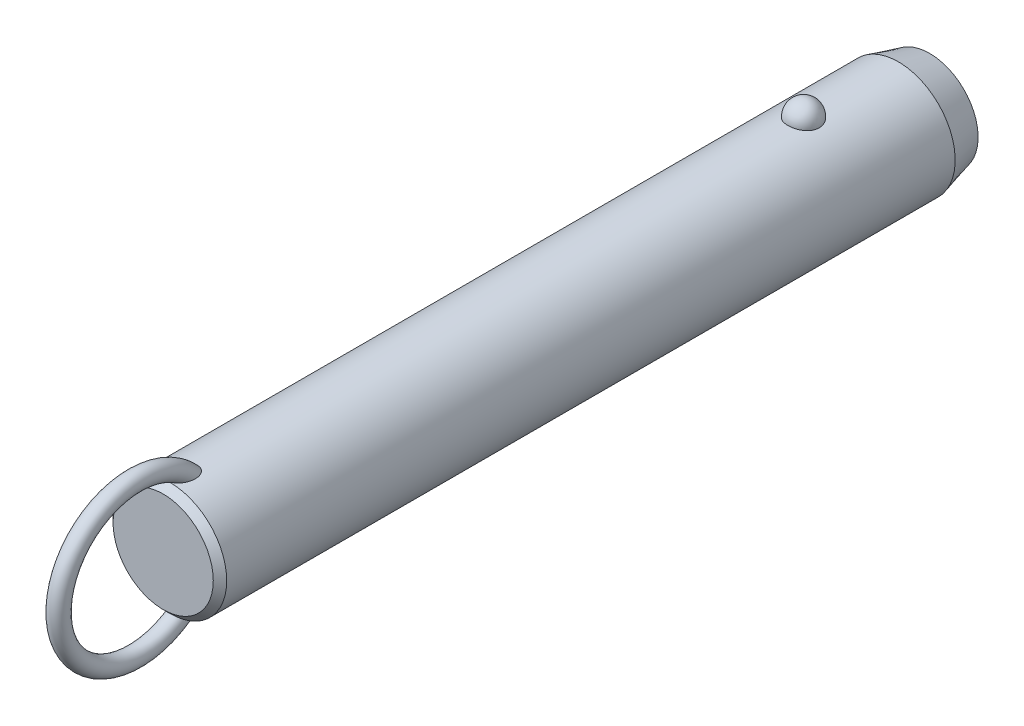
ISO-10303-21;
HEADER;
FILE_DESCRIPTION(('STEP AP214'),'2;1');
FILE_NAME('part.step','',(''),(''),'','','');
FILE_SCHEMA(('AUTOMOTIVE_DESIGN { 1 0 10303 214 1 1 1 1 }'));
ENDSEC;
DATA;
#1=APPLICATION_CONTEXT('core data for automotive mechanical design processes');
#2=APPLICATION_PROTOCOL_DEFINITION('international standard','automotive_design',2000,#1);
#3=PRODUCT_CONTEXT('',#1,'mechanical');
#4=PRODUCT('Part','Part','',(#3));
#5=PRODUCT_RELATED_PRODUCT_CATEGORY('part','',(#4));
#6=PRODUCT_DEFINITION_FORMATION('','',#4);
#7=PRODUCT_DEFINITION_CONTEXT('part definition',#1,'design');
#8=PRODUCT_DEFINITION('design','',#6,#7);
#9=PRODUCT_DEFINITION_SHAPE('','',#8);
#10=(LENGTH_UNIT() NAMED_UNIT(*) SI_UNIT(.MILLI.,.METRE.));
#11=(NAMED_UNIT(*) PLANE_ANGLE_UNIT() SI_UNIT($,.RADIAN.));
#12=(NAMED_UNIT(*) SI_UNIT($,.STERADIAN.) SOLID_ANGLE_UNIT());
#13=UNCERTAINTY_MEASURE_WITH_UNIT(LENGTH_MEASURE(1.E-05),#10,'distance_accuracy_value','');
#14=(GEOMETRIC_REPRESENTATION_CONTEXT(3) GLOBAL_UNCERTAINTY_ASSIGNED_CONTEXT((#13)) GLOBAL_UNIT_ASSIGNED_CONTEXT((#10,
#11,#12)) REPRESENTATION_CONTEXT('',''));
#15=CARTESIAN_POINT('',(0.,0.,0.));
#16=DIRECTION('',(0.,0.,1.));
#17=DIRECTION('',(1.,0.,0.));
#18=AXIS2_PLACEMENT_3D('',#15,#16,#17);
#19=CARTESIAN_POINT('',(0.,0.,127.));
#20=DIRECTION('',(0.,0.,-1.));
#21=DIRECTION('',(-1.,0.,0.));
#22=AXIS2_PLACEMENT_3D('',#19,#20,#21);
#23=CYLINDRICAL_SURFACE('',#22,12.7);
#24=CARTESIAN_POINT('',(3.46661256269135,12.2177165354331,-3.5));
#25=CARTESIAN_POINT('',(3.4666090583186,12.2177194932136,-3.30432790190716));
#26=CARTESIAN_POINT('',(3.45063567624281,12.2222841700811,-3.10861112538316));
#27=CARTESIAN_POINT('',(3.38712451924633,12.2400345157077,-2.72271899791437));
#28=CARTESIAN_POINT('',(3.33957415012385,12.2532236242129,-2.53254588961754));
#29=CARTESIAN_POINT('',(3.2141234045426,12.286724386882,-2.16324948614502));
#30=CARTESIAN_POINT('',(3.13623639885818,12.3070329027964,-1.98412136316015));
#31=CARTESIAN_POINT('',(2.95205930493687,12.3525018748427,-1.64180592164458));
#32=CARTESIAN_POINT('',(2.84577003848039,12.3776621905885,-1.47861814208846));
#33=CARTESIAN_POINT('',(2.60688050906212,12.4301712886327,-1.17190583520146));
#34=CARTESIAN_POINT('',(2.47415697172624,12.4575299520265,-1.02847897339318));
#35=CARTESIAN_POINT('',(2.18615174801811,12.5112810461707,-0.766177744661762));
#36=CARTESIAN_POINT('',(2.03087002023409,12.5376734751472,-0.64730342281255));
#37=CARTESIAN_POINT('',(1.70237334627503,12.5864761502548,-0.437732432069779));
#38=CARTESIAN_POINT('',(1.52920948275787,12.6088972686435,-0.346958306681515));
#39=CARTESIAN_POINT('',(1.16944170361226,12.6473352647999,-0.195750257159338));
#40=CARTESIAN_POINT('',(0.982839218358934,12.663352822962,-0.135313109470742));
#41=CARTESIAN_POINT('',(0.604961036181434,12.6869706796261,-0.0473241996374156));
#42=CARTESIAN_POINT('',(0.41382314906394,12.6947125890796,-0.0192185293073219));
#43=CARTESIAN_POINT('',(0.0293827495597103,12.7014203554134,0.0051725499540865));
#44=CARTESIAN_POINT('',(-0.163919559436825,12.7003870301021,0.00146092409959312));
#45=CARTESIAN_POINT('',(-0.544374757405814,12.689735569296,-0.0373939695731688));
#46=CARTESIAN_POINT('',(-0.731575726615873,12.6802364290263,-0.0721015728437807));
#47=CARTESIAN_POINT('',(-1.09733277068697,12.6538333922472,-0.171364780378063));
#48=CARTESIAN_POINT('',(-1.27588869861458,12.6369293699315,-0.235920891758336));
#49=CARTESIAN_POINT('',(-1.6204698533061,12.5973946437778,-0.393548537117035));
#50=CARTESIAN_POINT('',(-1.78641865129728,12.5747321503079,-0.486778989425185));
#51=CARTESIAN_POINT('',(-2.10030671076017,12.5261316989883,-0.699110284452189));
#52=CARTESIAN_POINT('',(-2.24824419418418,12.5001934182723,-0.818213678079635));
#53=CARTESIAN_POINT('',(-2.52491489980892,12.4472906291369,-1.08157124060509));
#54=CARTESIAN_POINT('',(-2.65324222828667,12.4203160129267,-1.22624992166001));
#55=CARTESIAN_POINT('',(-2.88410007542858,12.3687509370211,-1.53528325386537));
#56=CARTESIAN_POINT('',(-2.98662883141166,12.3441606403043,-1.69963924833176));
#57=CARTESIAN_POINT('',(-3.16432417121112,12.2998199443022,-2.04548497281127));
#58=CARTESIAN_POINT('',(-3.23917525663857,12.2801261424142,-2.22714424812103));
#59=CARTESIAN_POINT('',(-3.35800573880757,12.248167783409,-2.6009138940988));
#60=CARTESIAN_POINT('',(-3.4019860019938,12.2359030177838,-2.79302397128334));
#61=CARTESIAN_POINT('',(-3.45784812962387,12.2202347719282,-3.18140279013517));
#62=CARTESIAN_POINT('',(-3.46986123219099,12.2167950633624,-3.37765118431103));
#63=CARTESIAN_POINT('',(-3.46186273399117,12.2190638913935,-3.76943689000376));
#64=CARTESIAN_POINT('',(-3.44185196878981,12.2247721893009,-3.96497421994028));
#65=CARTESIAN_POINT('',(-3.37048652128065,12.2446381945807,-4.34881728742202));
#66=CARTESIAN_POINT('',(-3.31928253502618,12.2587552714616,-4.53715319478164));
#67=CARTESIAN_POINT('',(-3.18693461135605,12.2938237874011,-4.90231727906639));
#68=CARTESIAN_POINT('',(-3.1057895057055,12.3147754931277,-5.07914500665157));
#69=CARTESIAN_POINT('',(-2.91506431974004,12.3613125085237,-5.41732059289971));
#70=CARTESIAN_POINT('',(-2.80533587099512,12.3869217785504,-5.57858147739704));
#71=CARTESIAN_POINT('',(-2.560414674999,12.4398525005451,-5.88013283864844));
#72=CARTESIAN_POINT('',(-2.42522099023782,12.4671740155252,-6.02042254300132));
#73=CARTESIAN_POINT('',(-2.1323357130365,12.5205965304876,-6.27662798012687));
#74=CARTESIAN_POINT('',(-1.97456596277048,12.5466928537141,-6.3924554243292));
#75=CARTESIAN_POINT('',(-1.64115839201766,12.5946384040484,-6.59583547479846));
#76=CARTESIAN_POINT('',(-1.46552179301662,12.6164879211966,-6.68339001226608));
#77=CARTESIAN_POINT('',(-1.10356050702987,12.6532533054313,-6.82682153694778));
#78=CARTESIAN_POINT('',(-0.9173913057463,12.6682500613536,-6.8830698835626));
#79=CARTESIAN_POINT('',(-0.537836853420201,12.6900288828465,-6.96386887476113));
#80=CARTESIAN_POINT('',(-0.344452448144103,12.6968119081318,-6.9884232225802));
#81=CARTESIAN_POINT('',(0.0402577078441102,12.7013667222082,-7.00496469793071));
#82=CARTESIAN_POINT('',(0.231556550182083,12.6993008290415,-6.99753844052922));
#83=CARTESIAN_POINT('',(0.610105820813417,12.6867505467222,-6.9516636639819));
#84=CARTESIAN_POINT('',(0.797356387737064,12.6762664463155,-6.913216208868));
#85=CARTESIAN_POINT('',(1.16186657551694,12.6480587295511,-6.80658431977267));
#86=CARTESIAN_POINT('',(1.33915951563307,12.6303611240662,-6.73850666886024));
#87=CARTESIAN_POINT('',(1.67968518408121,12.5896027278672,-6.5745087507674));
#88=CARTESIAN_POINT('',(1.84291705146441,12.5665416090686,-6.47858678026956));
#89=CARTESIAN_POINT('',(2.15340192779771,12.5171072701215,-6.25982455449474));
#90=CARTESIAN_POINT('',(2.30037831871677,12.4906895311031,-6.13660186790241));
#91=CARTESIAN_POINT('',(2.5717412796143,12.4376567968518,-5.86739587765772));
#92=CARTESIAN_POINT('',(2.69612388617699,12.4110417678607,-5.72140858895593));
#93=CARTESIAN_POINT('',(2.92107785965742,12.360051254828,-5.40794137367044));
#94=CARTESIAN_POINT('',(3.02121329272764,12.3357209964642,-5.24014110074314));
#95=CARTESIAN_POINT('',(3.19236291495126,12.2925446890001,-4.88969865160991));
#96=CARTESIAN_POINT('',(3.26338839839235,12.2736965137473,-4.70706226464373));
#97=CARTESIAN_POINT('',(3.36788038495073,12.245404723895,-4.35469510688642));
#98=CARTESIAN_POINT('',(3.40484026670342,12.2351018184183,-4.18605935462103));
#99=CARTESIAN_POINT('',(3.45420764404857,12.2212564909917,-3.84496058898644));
#100=CARTESIAN_POINT('',(3.46661565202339,12.2177139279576,-3.67249765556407));
#101=CARTESIAN_POINT('',(3.46661256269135,12.2177165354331,-3.5));
#102=B_SPLINE_CURVE_WITH_KNOTS('',3,(#24,#25,#26,#27,#28,#29,#30,#31,#32,#33,#34,#35,#36,#37,
#38,#39,#40,#41,#42,#43,#44,#45,#46,#47,#48,#49,#50,#51,#52,#53,#54,#55,#56,#57,#58,#59,#60,#61,
#62,#63,#64,#65,#66,#67,#68,#69,#70,#71,#72,#73,#74,#75,#76,#77,#78,#79,#80,#81,#82,#83,#84,#85,
#86,#87,#88,#89,#90,#91,#92,#93,#94,#95,#96,#97,#98,#99,#100,#101),.UNSPECIFIED.,.T.,.F.,(4,2,2,
2,2,2,2,2,2,2,2,2,2,2,2,2,2,2,2,2,2,2,2,2,2,2,2,2,2,2,2,2,2,2,2,2,2,2,4),(0.,0.586396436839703,
1.17302689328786,1.7593990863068,2.34575431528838,2.93491084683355,3.52406845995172,
4.11158733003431,4.69904375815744,5.2762784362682,5.85345931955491,6.42265312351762,
6.99185659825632,7.56427334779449,8.136746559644,8.71981013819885,9.3029135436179,
9.89247258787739,10.4820150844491,11.0691335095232,11.6562366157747,12.2405256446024,
12.8248374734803,13.412244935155,13.9996740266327,14.5891883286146,15.1786623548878,
15.7609861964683,16.3432419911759,16.9148635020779,17.4864654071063,18.0560241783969,
18.6256177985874,19.2037609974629,19.7820055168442,20.3699810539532,20.957728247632,
21.4746855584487,21.9916320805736),.UNSPECIFIED.);
#103=CARTESIAN_POINT('',(3.46661256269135,12.2177165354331,-3.5));
#104=VERTEX_POINT('',#103);
#105=EDGE_CURVE('E41',#104,#104,#102,.T.);
#106=ORIENTED_EDGE('',*,*,#105,.T.);
#107=EDGE_LOOP('',(#106));
#108=FACE_BOUND('',#107,.T.);
#109=CARTESIAN_POINT('',(0.,0.,138.2));
#110=DIRECTION('',(0.,0.,1.));
#111=DIRECTION('',(1.,0.,0.));
#112=AXIS2_PLACEMENT_3D('',#109,#110,#111);
#113=CIRCLE('',#112,12.7);
#114=CARTESIAN_POINT('',(12.7,0.,138.2));
#115=VERTEX_POINT('',#114);
#116=EDGE_CURVE('E10',#115,#115,#113,.F.);
#117=ORIENTED_EDGE('',*,*,#116,.T.);
#118=EDGE_LOOP('',(#117));
#119=FACE_BOUND('',#118,.T.);
#120=CARTESIAN_POINT('',(-0.548122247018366,-12.6881662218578,131.943218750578));
#121=CARTESIAN_POINT('',(-0.648865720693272,-12.6838128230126,131.977926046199));
#122=CARTESIAN_POINT('',(-0.746398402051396,-12.6783867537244,132.022042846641));
#123=CARTESIAN_POINT('',(-0.932125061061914,-12.666091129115,132.126764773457));
#124=CARTESIAN_POINT('',(-1.02030388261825,-12.6592192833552,132.187396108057));
#125=CARTESIAN_POINT('',(-1.18487740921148,-12.6448747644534,132.321847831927));
#126=CARTESIAN_POINT('',(-1.26134296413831,-12.637406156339,132.395582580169));
#127=CARTESIAN_POINT('',(-1.4023120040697,-12.6225412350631,132.553604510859));
#128=CARTESIAN_POINT('',(-1.466814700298,-12.6151449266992,132.63789238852));
#129=CARTESIAN_POINT('',(-1.60714786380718,-12.5981718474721,132.849657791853));
#130=CARTESIAN_POINT('',(-1.67725126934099,-12.588900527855,132.980962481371));
#131=CARTESIAN_POINT('',(-1.79536591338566,-12.5725964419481,133.253247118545));
#132=CARTESIAN_POINT('',(-1.84333535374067,-12.5655679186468,133.394244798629));
#133=CARTESIAN_POINT('',(-1.93422576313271,-12.5519624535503,133.737645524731));
#134=CARTESIAN_POINT('',(-1.96788773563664,-12.5466298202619,133.942557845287));
#135=CARTESIAN_POINT('',(-1.9941399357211,-12.542463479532,134.251760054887));
#136=CARTESIAN_POINT('',(-1.99883864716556,-12.5417153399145,134.355298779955));
#137=CARTESIAN_POINT('',(-2.00078003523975,-12.5414074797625,134.56245124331));
#138=CARTESIAN_POINT('',(-1.99802449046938,-12.5418474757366,134.666064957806));
#139=CARTESIAN_POINT('',(-1.98336733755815,-12.5441750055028,134.91032076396));
#140=CARTESIAN_POINT('',(-1.96851430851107,-12.5465291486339,135.050780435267));
#141=CARTESIAN_POINT('',(-1.92707089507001,-12.5529612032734,135.329960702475));
#142=CARTESIAN_POINT('',(-1.90047458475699,-12.5570399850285,135.468680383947));
#143=CARTESIAN_POINT('',(-1.8361912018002,-12.5666008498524,135.74341135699));
#144=CARTESIAN_POINT('',(-1.79850828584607,-12.57208240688,135.879423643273));
#145=CARTESIAN_POINT('',(-1.71223796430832,-12.5841228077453,136.147842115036));
#146=CARTESIAN_POINT('',(-1.66365679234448,-12.5906810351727,136.280250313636));
#147=CARTESIAN_POINT('',(-1.5780450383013,-12.6016176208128,136.48548877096));
#148=CARTESIAN_POINT('',(-1.54477252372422,-12.6057501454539,136.559914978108));
#149=CARTESIAN_POINT('',(-1.47424480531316,-12.6141930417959,136.706839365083));
#150=CARTESIAN_POINT('',(-1.436990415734,-12.6185033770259,136.779337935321));
#151=CARTESIAN_POINT('',(-1.35825795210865,-12.6272207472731,136.921892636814));
#152=CARTESIAN_POINT('',(-1.31678520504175,-12.6316276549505,136.991951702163));
#153=CARTESIAN_POINT('',(-1.22917793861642,-12.6404532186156,137.129070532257));
#154=CARTESIAN_POINT('',(-1.18304514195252,-12.6448718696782,137.196131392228));
#155=CARTESIAN_POINT('',(-1.07246411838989,-12.6547893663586,137.343874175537));
#156=CARTESIAN_POINT('',(-1.00642239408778,-12.6602600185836,137.423384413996));
#157=CARTESIAN_POINT('',(-0.86444142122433,-12.6707460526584,137.573169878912));
#158=CARTESIAN_POINT('',(-0.788516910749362,-12.6757620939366,137.643458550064));
#159=CARTESIAN_POINT('',(-0.652215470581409,-12.6833591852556,137.748680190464));
#160=CARTESIAN_POINT('',(-0.59498203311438,-12.6861973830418,137.787624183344));
#161=CARTESIAN_POINT('',(-0.475269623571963,-12.6912445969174,137.856489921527));
#162=CARTESIAN_POINT('',(-0.412800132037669,-12.6934547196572,137.886427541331));
#163=CARTESIAN_POINT('',(-0.295749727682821,-12.6966636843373,137.92975652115));
#164=CARTESIAN_POINT('',(-0.241949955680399,-12.6978134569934,137.945218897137));
#165=CARTESIAN_POINT('',(-0.132508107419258,-12.6994261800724,137.966884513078));
#166=CARTESIAN_POINT('',(-0.0768679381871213,-12.6998898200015,137.973097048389));
#167=CARTESIAN_POINT('',(0.0347696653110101,-12.7000752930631,137.975583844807));
#168=CARTESIAN_POINT('',(0.0907676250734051,-12.6997954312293,137.971835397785));
#169=CARTESIAN_POINT('',(0.201283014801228,-12.6985255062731,137.954788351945));
#170=CARTESIAN_POINT('',(0.255799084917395,-12.6975348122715,137.941481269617));
#171=CARTESIAN_POINT('',(0.376042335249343,-12.6946091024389,137.90203792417));
#172=CARTESIAN_POINT('',(0.440950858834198,-12.6924943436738,137.873449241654));
#173=CARTESIAN_POINT('',(0.565350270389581,-12.6875639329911,137.806323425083));
#174=CARTESIAN_POINT('',(0.624828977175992,-12.6847467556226,137.767764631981));
#175=CARTESIAN_POINT('',(0.774116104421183,-12.6767252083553,137.656949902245));
#176=CARTESIAN_POINT('',(0.859449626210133,-12.6711344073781,137.578760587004));
#177=CARTESIAN_POINT('',(1.01789440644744,-12.6593922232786,137.410943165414));
#178=CARTESIAN_POINT('',(1.09096902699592,-12.653239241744,137.321282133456));
#179=CARTESIAN_POINT('',(1.22268793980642,-12.6411674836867,137.140265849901));
#180=CARTESIAN_POINT('',(1.28193986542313,-12.6352572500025,137.049345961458));
#181=CARTESIAN_POINT('',(1.39259777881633,-12.6235401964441,136.862792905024));
#182=CARTESIAN_POINT('',(1.44399707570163,-12.6177334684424,136.767155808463));
#183=CARTESIAN_POINT('',(1.53972870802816,-12.6064093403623,136.572273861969));
#184=CARTESIAN_POINT('',(1.58405262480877,-12.6008922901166,136.473024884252));
#185=CARTESIAN_POINT('',(1.66600705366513,-12.5903187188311,136.271772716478));
#186=CARTESIAN_POINT('',(1.70363651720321,-12.5852622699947,136.169769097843));
#187=CARTESIAN_POINT('',(1.77545379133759,-12.5753406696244,135.954358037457));
#188=CARTESIAN_POINT('',(1.80903453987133,-12.5705328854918,135.840745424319));
#189=CARTESIAN_POINT('',(1.86844163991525,-12.5618400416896,135.611457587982));
#190=CARTESIAN_POINT('',(1.89426665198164,-12.5579551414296,135.495782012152));
#191=CARTESIAN_POINT('',(1.93785464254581,-12.5513030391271,135.263007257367));
#192=CARTESIAN_POINT('',(1.95562640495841,-12.5485346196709,135.145909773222));
#193=CARTESIAN_POINT('',(1.98264463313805,-12.5442934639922,134.910747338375));
#194=CARTESIAN_POINT('',(1.99189298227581,-12.5428204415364,134.79268260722));
#195=CARTESIAN_POINT('',(2.00416068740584,-12.540871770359,134.480622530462));
#196=CARTESIAN_POINT('',(1.99944433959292,-12.541631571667,134.286229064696));
#197=CARTESIAN_POINT('',(1.96113755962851,-12.5476846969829,133.900309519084));
#198=CARTESIAN_POINT('',(1.92758341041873,-12.5529723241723,133.708780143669));
#199=CARTESIAN_POINT('',(1.83934342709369,-12.5661532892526,133.382272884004));
#200=CARTESIAN_POINT('',(1.79215440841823,-12.5730485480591,133.24524997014));
#201=CARTESIAN_POINT('',(1.67676242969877,-12.588958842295,132.980445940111));
#202=CARTESIAN_POINT('',(1.60859050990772,-12.597970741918,132.852651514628));
#203=CARTESIAN_POINT('',(1.46583832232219,-12.6152829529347,132.635800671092));
#204=CARTESIAN_POINT('',(1.39525727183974,-12.6233659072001,132.54410500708));
#205=CARTESIAN_POINT('',(1.23992594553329,-12.6395676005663,132.373485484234));
#206=CARTESIAN_POINT('',(1.15517932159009,-12.6476863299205,132.294558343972));
#207=CARTESIAN_POINT('',(0.971995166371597,-12.6630846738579,132.152643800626));
#208=CARTESIAN_POINT('',(0.873456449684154,-12.6703572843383,132.089784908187));
#209=CARTESIAN_POINT('',(0.665847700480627,-12.6829569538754,131.984487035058));
#210=CARTESIAN_POINT('',(0.556784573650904,-12.688285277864,131.942034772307));
#211=CARTESIAN_POINT('',(0.347338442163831,-12.6956226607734,131.884443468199));
#212=CARTESIAN_POINT('',(0.247759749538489,-12.6979816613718,131.866399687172));
#213=CARTESIAN_POINT('',(0.0470218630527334,-12.7003077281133,131.848600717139));
#214=CARTESIAN_POINT('',(-0.0541350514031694,-12.7002779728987,131.848821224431));
#215=CARTESIAN_POINT('',(-0.221414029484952,-12.6982482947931,131.864363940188));
#216=CARTESIAN_POINT('',(-0.288055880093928,-12.6969033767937,131.874666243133));
#217=CARTESIAN_POINT('',(-0.419599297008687,-12.6932369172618,131.90313489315));
#218=CARTESIAN_POINT('',(-0.484501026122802,-12.6909154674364,131.921300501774));
#219=CARTESIAN_POINT('',(-0.548122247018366,-12.6881662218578,131.943218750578));
#220=B_SPLINE_CURVE_WITH_KNOTS('',3,(#120,#121,#122,#123,#124,#125,#126,#127,#128,#129,#130,
#131,#132,#133,#134,#135,#136,#137,#138,#139,#140,#141,#142,#143,#144,#145,#146,#147,#148,#149,
#150,#151,#152,#153,#154,#155,#156,#157,#158,#159,#160,#161,#162,#163,#164,#165,#166,#167,#168,
#169,#170,#171,#172,#173,#174,#175,#176,#177,#178,#179,#180,#181,#182,#183,#184,#185,#186,#187,
#188,#189,#190,#191,#192,#193,#194,#195,#196,#197,#198,#199,#200,#201,#202,#203,#204,#205,#206,
#207,#208,#209,#210,#211,#212,#213,#214,#215,#216,#217,#218,#219),.UNSPECIFIED.,.T.,.F.,(4,2,2,
2,2,2,2,2,2,2,2,2,2,2,2,2,2,2,2,2,2,2,2,2,2,2,2,2,2,2,2,2,2,2,2,2,2,2,2,2,2,2,2,2,2,2,2,2,2,4),
(0.,0.31964225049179,0.639794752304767,0.957927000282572,1.27608021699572,1.72100165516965,
2.16675988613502,2.78630021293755,3.09705782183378,3.40774128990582,3.83096358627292,
4.25439969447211,4.67767724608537,5.10071330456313,5.34550297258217,5.59024267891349,
5.83467707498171,6.07902143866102,6.38891080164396,6.69834321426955,6.9056091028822,
7.11250749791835,7.27977315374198,7.44687060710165,7.61434932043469,7.78197685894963,
7.99365544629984,8.20579780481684,8.55147335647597,8.89816429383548,9.22375138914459,
9.54961437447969,9.8758622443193,10.202161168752,10.557587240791,10.9130746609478,
11.2681734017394,11.6231936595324,12.2046601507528,12.7853961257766,13.219164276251,
13.6522938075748,13.9989174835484,14.3454519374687,14.6946768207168,15.0436740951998,
15.3457513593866,15.6474266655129,15.8493051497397,16.0511646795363),.UNSPECIFIED.);
#221=CARTESIAN_POINT('',(-0.548122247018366,-12.6881662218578,131.943218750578));
#222=VERTEX_POINT('',#221);
#223=EDGE_CURVE('E59',#222,#222,#220,.T.);
#224=ORIENTED_EDGE('',*,*,#223,.T.);
#225=EDGE_LOOP('',(#224));
#226=FACE_BOUND('',#225,.T.);
#227=CARTESIAN_POINT('',(-0.548122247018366,12.6881662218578,131.943218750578));
#228=CARTESIAN_POINT('',(-0.459436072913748,12.6919968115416,131.912673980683));
#229=CARTESIAN_POINT('',(-0.368189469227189,12.6949996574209,131.889391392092));
#230=CARTESIAN_POINT('',(-0.183024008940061,12.6990186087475,131.858406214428));
#231=CARTESIAN_POINT('',(-0.0891049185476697,12.7000345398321,131.850704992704));
#232=CARTESIAN_POINT('',(0.0987147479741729,12.6999636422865,131.851245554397));
#233=CARTESIAN_POINT('',(0.192615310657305,12.6988761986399,131.859492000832));
#234=CARTESIAN_POINT('',(0.377658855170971,12.6947211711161,131.891551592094));
#235=CARTESIAN_POINT('',(0.468801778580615,12.6916535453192,131.915365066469));
#236=CARTESIAN_POINT('',(0.645809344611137,12.6838788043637,131.97745651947));
#237=CARTESIAN_POINT('',(0.731679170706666,12.6791733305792,132.015720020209));
#238=CARTESIAN_POINT('',(0.896315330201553,12.6686004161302,132.105120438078));
#239=CARTESIAN_POINT('',(0.97508059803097,12.6627328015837,132.156259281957));
#240=CARTESIAN_POINT('',(1.12963655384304,12.6499161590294,132.27367820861));
#241=CARTESIAN_POINT('',(1.20478673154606,12.6429194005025,132.340792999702));
#242=CARTESIAN_POINT('',(1.34448241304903,12.6288282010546,132.48522507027));
#243=CARTESIAN_POINT('',(1.40902173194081,12.621733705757,132.562548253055));
#244=CARTESIAN_POINT('',(1.55208211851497,12.6050877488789,132.759247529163));
#245=CARTESIAN_POINT('',(1.62510490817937,12.5957546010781,132.882654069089));
#246=CARTESIAN_POINT('',(1.7501904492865,12.5789823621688,133.139769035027));
#247=CARTESIAN_POINT('',(1.8022137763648,12.5715468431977,133.273496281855));
#248=CARTESIAN_POINT('',(1.90309965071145,12.5567434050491,133.598351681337));
#249=CARTESIAN_POINT('',(1.94342317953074,12.5504515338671,133.792161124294));
#250=CARTESIAN_POINT('',(1.99332997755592,12.5426147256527,134.18378810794));
#251=CARTESIAN_POINT('',(2.00285305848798,12.5410790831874,134.381612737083));
#252=CARTESIAN_POINT('',(1.99678999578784,12.5420407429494,134.716642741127));
#253=CARTESIAN_POINT('',(1.98794117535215,12.5434564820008,134.854042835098));
#254=CARTESIAN_POINT('',(1.95865119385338,12.5480641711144,135.127639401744));
#255=CARTESIAN_POINT('',(1.93820436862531,12.5512569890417,135.263835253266));
#256=CARTESIAN_POINT('',(1.88647896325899,12.5591352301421,135.534249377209));
#257=CARTESIAN_POINT('',(1.85518800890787,12.5638223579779,135.668465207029));
#258=CARTESIAN_POINT('',(1.78217886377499,12.5743868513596,135.933936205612));
#259=CARTESIAN_POINT('',(1.74046509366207,12.5802637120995,136.065192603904));
#260=CARTESIAN_POINT('',(1.66024095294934,12.5910571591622,136.286085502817));
#261=CARTESIAN_POINT('',(1.62434772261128,12.5957535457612,136.376690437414));
#262=CARTESIAN_POINT('',(1.54709009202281,12.6054762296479,136.555512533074));
#263=CARTESIAN_POINT('',(1.50572681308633,12.6105024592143,136.643730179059));
#264=CARTESIAN_POINT('',(1.41728020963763,12.620748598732,136.816932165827));
#265=CARTESIAN_POINT('',(1.37021377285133,12.625967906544,136.901925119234));
#266=CARTESIAN_POINT('',(1.26969620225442,12.6364721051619,137.068007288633));
#267=CARTESIAN_POINT('',(1.21624929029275,12.6417569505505,137.149099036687));
#268=CARTESIAN_POINT('',(1.10304413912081,12.6521331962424,137.304702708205));
#269=CARTESIAN_POINT('',(1.04340936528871,12.657226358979,137.379303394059));
#270=CARTESIAN_POINT('',(0.915919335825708,12.667090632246,137.521324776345));
#271=CARTESIAN_POINT('',(0.84806456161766,12.6718617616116,137.58874589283));
#272=CARTESIAN_POINT('',(0.717035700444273,12.67987711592,137.700624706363));
#273=CARTESIAN_POINT('',(0.655526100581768,12.6832377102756,137.746997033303));
#274=CARTESIAN_POINT('',(0.525985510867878,12.6892676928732,137.829619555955));
#275=CARTESIAN_POINT('',(0.457969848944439,12.6919386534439,137.865892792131));
#276=CARTESIAN_POINT('',(0.334859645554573,12.695691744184,137.916657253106));
#277=CARTESIAN_POINT('',(0.281116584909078,12.6970073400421,137.934373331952));
#278=CARTESIAN_POINT('',(0.171425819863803,12.6989609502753,137.960642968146));
#279=CARTESIAN_POINT('',(0.115480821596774,12.699599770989,137.969207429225));
#280=CARTESIAN_POINT('',(0.00272618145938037,12.7001251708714,137.976253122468));
#281=CARTESIAN_POINT('',(-0.0540859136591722,12.7000089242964,137.974696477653));
#282=CARTESIAN_POINT('',(-0.16654462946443,12.6990328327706,137.961600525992));
#283=CARTESIAN_POINT('',(-0.222190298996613,12.6981724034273,137.950053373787));
#284=CARTESIAN_POINT('',(-0.342018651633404,12.695562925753,137.914912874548));
#285=CARTESIAN_POINT('',(-0.405606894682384,12.6936676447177,137.88933225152));
#286=CARTESIAN_POINT('',(-0.527815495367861,12.6891754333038,137.828311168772));
#287=CARTESIAN_POINT('',(-0.586425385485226,12.6865770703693,137.792850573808));
#288=CARTESIAN_POINT('',(-0.731842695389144,12.6792129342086,137.691496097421));
#289=CARTESIAN_POINT('',(-0.81470941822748,12.6740767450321,137.6200395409));
#290=CARTESIAN_POINT('',(-0.969101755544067,12.6632083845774,137.46589007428));
#291=CARTESIAN_POINT('',(-1.04059564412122,12.6574746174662,137.383166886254));
#292=CARTESIAN_POINT('',(-1.16981116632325,12.6461638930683,137.215809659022));
#293=CARTESIAN_POINT('',(-1.22811369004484,12.6405994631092,137.131616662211));
#294=CARTESIAN_POINT('',(-1.33743405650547,12.6295007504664,136.958579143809));
#295=CARTESIAN_POINT('',(-1.38844577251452,12.6239664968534,136.869730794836));
#296=CARTESIAN_POINT('',(-1.48400702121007,12.6130898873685,136.688389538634));
#297=CARTESIAN_POINT('',(-1.52854232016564,12.6077479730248,136.595889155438));
#298=CARTESIAN_POINT('',(-1.61150113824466,12.5974127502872,136.408160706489));
#299=CARTESIAN_POINT('',(-1.64992317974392,12.5924195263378,136.312931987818));
#300=CARTESIAN_POINT('',(-1.73468589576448,12.581070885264,136.08289362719));
#301=CARTESIAN_POINT('',(-1.77831261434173,12.5749388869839,135.947066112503));
#302=CARTESIAN_POINT('',(-1.85439734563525,12.5639437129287,135.672212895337));
#303=CARTESIAN_POINT('',(-1.88684994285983,12.5590811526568,135.533185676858));
#304=CARTESIAN_POINT('',(-1.94008483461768,12.550968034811,135.25309235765));
#305=CARTESIAN_POINT('',(-1.96088706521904,12.5477147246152,135.112030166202));
#306=CARTESIAN_POINT('',(-1.99000539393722,12.5431291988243,134.828668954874));
#307=CARTESIAN_POINT('',(-1.99832911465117,12.5417958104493,134.686370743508));
#308=CARTESIAN_POINT('',(-2.00166624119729,12.5412674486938,134.357627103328));
#309=CARTESIAN_POINT('',(-1.99178843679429,12.5428579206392,134.171088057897));
#310=CARTESIAN_POINT('',(-1.94455183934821,12.5502731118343,133.80162404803));
#311=CARTESIAN_POINT('',(-1.90724032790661,12.5560905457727,133.618693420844));
#312=CARTESIAN_POINT('',(-1.81330718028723,12.5699462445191,133.304848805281));
#313=CARTESIAN_POINT('',(-1.76338820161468,12.5771273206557,133.171910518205));
#314=CARTESIAN_POINT('',(-1.64305018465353,12.593414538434,132.915681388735));
#315=CARTESIAN_POINT('',(-1.57265346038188,12.6025185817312,132.792380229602));
#316=CARTESIAN_POINT('',(-1.42634956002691,12.6198178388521,132.583564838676));
#317=CARTESIAN_POINT('',(-1.35423772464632,12.6278405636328,132.495384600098));
#318=CARTESIAN_POINT('',(-1.19645664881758,12.6437632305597,132.332107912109));
#319=CARTESIAN_POINT('',(-1.1108053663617,12.6516633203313,132.256994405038));
#320=CARTESIAN_POINT('',(-0.947219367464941,12.6648319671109,132.137811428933));
#321=CARTESIAN_POINT('',(-0.871624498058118,12.670300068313,132.090541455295));
#322=CARTESIAN_POINT('',(-0.714161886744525,12.6801492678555,132.0077413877));
#323=CARTESIAN_POINT('',(-0.632295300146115,12.684530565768,131.97220913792));
#324=CARTESIAN_POINT('',(-0.548122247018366,12.6881662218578,131.943218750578));
#325=B_SPLINE_CURVE_WITH_KNOTS('',3,(#227,#228,#229,#230,#231,#232,#233,#234,#235,#236,#237,
#238,#239,#240,#241,#242,#243,#244,#245,#246,#247,#248,#249,#250,#251,#252,#253,#254,#255,#256,
#257,#258,#259,#260,#261,#262,#263,#264,#265,#266,#267,#268,#269,#270,#271,#272,#273,#274,#275,
#276,#277,#278,#279,#280,#281,#282,#283,#284,#285,#286,#287,#288,#289,#290,#291,#292,#293,#294,
#295,#296,#297,#298,#299,#300,#301,#302,#303,#304,#305,#306,#307,#308,#309,#310,#311,#312,#313,
#314,#315,#316,#317,#318,#319,#320,#321,#322,#323,#324),.UNSPECIFIED.,.T.,.F.,(4,2,2,2,2,2,2,2,
2,2,2,2,2,2,2,2,2,2,2,2,2,2,2,2,2,2,2,2,2,2,2,2,2,2,2,2,2,2,2,2,2,2,2,2,2,2,2,2,4),(0.,
0.281328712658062,0.562682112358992,0.844117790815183,1.12555942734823,1.40671982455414,
1.68792232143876,1.98972294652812,2.29169886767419,2.72039860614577,3.14989948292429,
3.74084916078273,4.33295293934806,4.74554109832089,5.15833092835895,5.57159335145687,
5.98468079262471,6.27722775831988,6.56971484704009,6.86135609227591,7.15280542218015,
7.43927407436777,7.72572595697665,7.95635862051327,8.18646071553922,8.35559393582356,
8.52452541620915,8.69408946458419,8.86378678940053,9.06834348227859,9.27332014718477,
9.60010414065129,9.92778432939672,10.2350252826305,10.5425229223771,10.8506864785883,
11.15892440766,11.5867893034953,12.0148612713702,12.4421984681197,12.8692745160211,
13.4279365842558,13.9856380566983,14.4107062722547,14.835313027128,15.1765567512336,
15.517351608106,15.7844129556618,16.051425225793),.UNSPECIFIED.);
#326=CARTESIAN_POINT('',(-0.548122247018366,12.6881662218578,131.943218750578));
#327=VERTEX_POINT('',#326);
#328=EDGE_CURVE('E67',#327,#327,#325,.T.);
#329=ORIENTED_EDGE('',*,*,#328,.T.);
#330=EDGE_LOOP('',(#329));
#331=FACE_BOUND('',#330,.T.);
#332=CARTESIAN_POINT('',(0.,0.,-24.6999999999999));
#333=DIRECTION('',(0.,0.,-1.));
#334=DIRECTION('',(-1.,0.,0.));
#335=AXIS2_PLACEMENT_3D('',#332,#333,#334);
#336=CIRCLE('',#335,12.7);
#337=CARTESIAN_POINT('',(-12.7,0.,-24.6999999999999));
#338=VERTEX_POINT('',#337);
#339=EDGE_CURVE('E56',#338,#338,#336,.F.);
#340=ORIENTED_EDGE('',*,*,#339,.T.);
#341=EDGE_LOOP('',(#340));
#342=FACE_BOUND('',#341,.T.);
#343=ADVANCED_FACE('F37',(#108,#119,#226,#331,#342),#23,.T.);
#344=CARTESIAN_POINT('',(0.,0.,-31.7));
#345=DIRECTION('',(0.,0.,-1.));
#346=DIRECTION('',(-1.,0.,0.));
#347=AXIS2_PLACEMENT_3D('',#344,#345,#346);
#348=PLANE('',#347);
#349=CARTESIAN_POINT('',(0.,0.,-31.7));
#350=DIRECTION('',(0.,0.,-1.));
#351=DIRECTION('',(-1.,0.,0.));
#352=AXIS2_PLACEMENT_3D('',#349,#350,#351);
#353=CIRCLE('',#352,10.8243556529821);
#354=CARTESIAN_POINT('',(-10.8243556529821,0.,-31.7));
#355=VERTEX_POINT('',#354);
#356=EDGE_CURVE('E66',#355,#355,#353,.T.);
#357=ORIENTED_EDGE('',*,*,#356,.T.);
#358=EDGE_LOOP('',(#357));
#359=FACE_BOUND('',#358,.T.);
#360=ADVANCED_FACE('F85',(#359),#348,.T.);
#361=CARTESIAN_POINT('',(0.,0.,-31.7));
#362=DIRECTION('',(0.,0.,1.));
#363=DIRECTION('',(1.,0.,0.));
#364=AXIS2_PLACEMENT_3D('',#361,#362,#363);
#365=CONICAL_SURFACE('',#364,10.8243556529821,0.261799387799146);
#366=ORIENTED_EDGE('',*,*,#339,.F.);
#367=EDGE_LOOP('',(#366));
#368=FACE_BOUND('',#367,.T.);
#369=ORIENTED_EDGE('',*,*,#356,.F.);
#370=EDGE_LOOP('',(#369));
#371=FACE_BOUND('',#370,.T.);
#372=ADVANCED_FACE('F83',(#368,#371),#365,.T.);
#373=CARTESIAN_POINT('',(0.,0.,139.7));
#374=DIRECTION('',(0.,0.,1.));
#375=DIRECTION('',(1.,0.,0.));
#376=AXIS2_PLACEMENT_3D('',#373,#374,#375);
#377=PLANE('',#376);
#378=CARTESIAN_POINT('',(0.,0.,139.7));
#379=DIRECTION('',(0.,0.,1.));
#380=DIRECTION('',(1.,0.,0.));
#381=AXIS2_PLACEMENT_3D('',#378,#379,#380);
#382=CIRCLE('',#381,11.2);
#383=CARTESIAN_POINT('',(11.2,0.,139.7));
#384=VERTEX_POINT('',#383);
#385=EDGE_CURVE('E50',#384,#384,#382,.T.);
#386=ORIENTED_EDGE('',*,*,#385,.T.);
#387=EDGE_LOOP('',(#386));
#388=FACE_BOUND('',#387,.T.);
#389=ADVANCED_FACE('F77',(#388),#377,.T.);
#390=CARTESIAN_POINT('',(0.,0.,146.05));
#391=DIRECTION('',(1.,0.,0.));
#392=DIRECTION('',(0.,0.,-1.));
#393=AXIS2_PLACEMENT_3D('',#390,#391,#392);
#394=TOROIDAL_SURFACE('',#393,17.05,2.);
#395=ORIENTED_EDGE('',*,*,#328,.F.);
#396=EDGE_LOOP('',(#395));
#397=FACE_BOUND('',#396,.T.);
#398=ORIENTED_EDGE('',*,*,#223,.F.);
#399=EDGE_LOOP('',(#398));
#400=FACE_BOUND('',#399,.T.);
#401=ADVANCED_FACE('F73',(#397,#400),#394,.T.);
#402=CARTESIAN_POINT('',(0.,0.,139.7));
#403=DIRECTION('',(0.,0.,-1.));
#404=DIRECTION('',(-1.,0.,0.));
#405=AXIS2_PLACEMENT_3D('',#402,#403,#404);
#406=CONICAL_SURFACE('',#405,11.2,0.785398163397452);
#407=ORIENTED_EDGE('',*,*,#116,.F.);
#408=EDGE_LOOP('',(#407));
#409=FACE_BOUND('',#408,.T.);
#410=ORIENTED_EDGE('',*,*,#385,.F.);
#411=EDGE_LOOP('',(#410));
#412=FACE_BOUND('',#411,.T.);
#413=ADVANCED_FACE('F39',(#409,#412),#406,.T.);
#414=CARTESIAN_POINT('',(0.,12.7,-3.5));
#415=DIRECTION('',(0.,1.,0.));
#416=DIRECTION('',(0.,0.,-1.));
#417=AXIS2_PLACEMENT_3D('',#414,#415,#416);
#418=SPHERICAL_SURFACE('',#417,3.5);
#419=ORIENTED_EDGE('',*,*,#105,.F.);
#420=EDGE_LOOP('',(#419));
#421=FACE_BOUND('',#420,.T.);
#422=ADVANCED_FACE('F79',(#421),#418,.T.);
#423=CLOSED_SHELL('',(#343,#360,#372,#389,#401,#413,#422));
#424=MANIFOLD_SOLID_BREP('B2',#423);
#425=ADVANCED_BREP_SHAPE_REPRESENTATION('',(#18,#424),#14);
#426=SHAPE_DEFINITION_REPRESENTATION(#9,#425);
ENDSEC;
END-ISO-10303-21;
